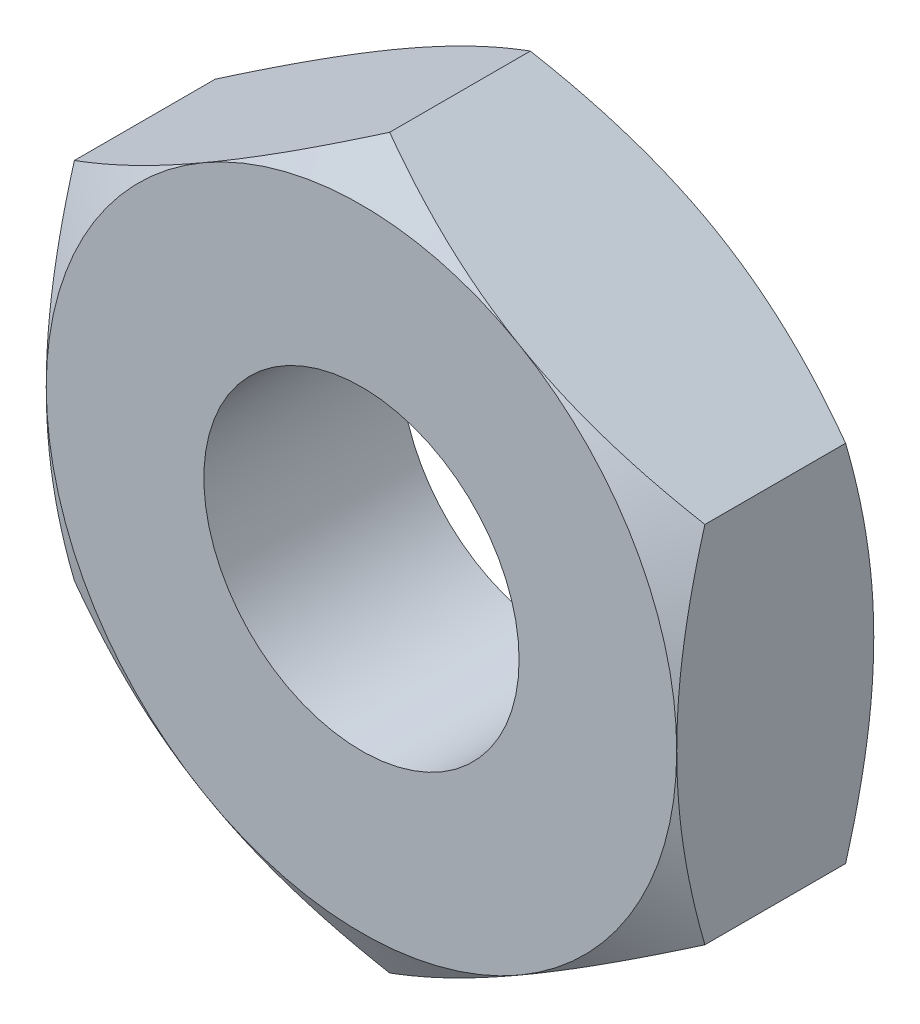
ISO-10303-21;
HEADER;
FILE_DESCRIPTION(('STEP AP214'),'2;1');
FILE_NAME('part.step','',(''),(''),'','','');
FILE_SCHEMA(('AUTOMOTIVE_DESIGN { 1 0 10303 214 1 1 1 1 }'));
ENDSEC;
DATA;
#1=APPLICATION_CONTEXT('core data for automotive mechanical design processes');
#2=APPLICATION_PROTOCOL_DEFINITION('international standard','automotive_design',2000,#1);
#3=PRODUCT_CONTEXT('',#1,'mechanical');
#4=PRODUCT('Part','Part','',(#3));
#5=PRODUCT_RELATED_PRODUCT_CATEGORY('part','',(#4));
#6=PRODUCT_DEFINITION_FORMATION('','',#4);
#7=PRODUCT_DEFINITION_CONTEXT('part definition',#1,'design');
#8=PRODUCT_DEFINITION('design','',#6,#7);
#9=PRODUCT_DEFINITION_SHAPE('','',#8);
#10=(LENGTH_UNIT() NAMED_UNIT(*) SI_UNIT(.MILLI.,.METRE.));
#11=(NAMED_UNIT(*) PLANE_ANGLE_UNIT() SI_UNIT($,.RADIAN.));
#12=(NAMED_UNIT(*) SI_UNIT($,.STERADIAN.) SOLID_ANGLE_UNIT());
#13=UNCERTAINTY_MEASURE_WITH_UNIT(LENGTH_MEASURE(1.E-05),#10,'distance_accuracy_value','');
#14=(GEOMETRIC_REPRESENTATION_CONTEXT(3) GLOBAL_UNCERTAINTY_ASSIGNED_CONTEXT((#13)) GLOBAL_UNIT_ASSIGNED_CONTEXT((#10,
#11,#12)) REPRESENTATION_CONTEXT('',''));
#15=CARTESIAN_POINT('',(0.,0.,0.));
#16=DIRECTION('',(0.,0.,1.));
#17=DIRECTION('',(1.,0.,0.));
#18=AXIS2_PLACEMENT_3D('',#15,#16,#17);
#19=CARTESIAN_POINT('',(-8.,13.856406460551,0.));
#20=DIRECTION('',(0.,0.,-1.));
#21=DIRECTION('',(-1.,0.,0.));
#22=AXIS2_PLACEMENT_3D('',#19,#20,#21);
#23=PLANE('',#22);
#24=CARTESIAN_POINT('',(0.,0.,0.));
#25=DIRECTION('',(0.,0.,-1.));
#26=DIRECTION('',(-1.,0.,0.));
#27=AXIS2_PLACEMENT_3D('',#24,#25,#26);
#28=CIRCLE('',#27,8.);
#29=CARTESIAN_POINT('',(-8.,0.,0.));
#30=VERTEX_POINT('',#29);
#31=CARTESIAN_POINT('',(-4.,6.92820323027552,0.));
#32=VERTEX_POINT('',#31);
#33=EDGE_CURVE('E474',#30,#32,#28,.T.);
#34=ORIENTED_EDGE('',*,*,#33,.F.);
#35=CARTESIAN_POINT('',(0.,0.,0.));
#36=DIRECTION('',(0.,0.,-1.));
#37=DIRECTION('',(-1.,0.,0.));
#38=AXIS2_PLACEMENT_3D('',#35,#36,#37);
#39=CIRCLE('',#38,8.);
#40=CARTESIAN_POINT('',(-4.,-6.92820323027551,0.));
#41=VERTEX_POINT('',#40);
#42=EDGE_CURVE('E151',#30,#41,#39,.F.);
#43=ORIENTED_EDGE('',*,*,#42,.T.);
#44=CARTESIAN_POINT('',(4.,-6.92820323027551,0.));
#45=VERTEX_POINT('',#44);
#46=EDGE_CURVE('E253',#41,#45,#39,.F.);
#47=ORIENTED_EDGE('',*,*,#46,.T.);
#48=CARTESIAN_POINT('',(8.,0.,0.));
#49=VERTEX_POINT('',#48);
#50=EDGE_CURVE('E155',#45,#49,#39,.F.);
#51=ORIENTED_EDGE('',*,*,#50,.T.);
#52=CARTESIAN_POINT('',(4.,6.92820323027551,0.));
#53=VERTEX_POINT('',#52);
#54=EDGE_CURVE('E129',#49,#53,#39,.F.);
#55=ORIENTED_EDGE('',*,*,#54,.T.);
#56=EDGE_CURVE('E142',#53,#32,#39,.F.);
#57=ORIENTED_EDGE('',*,*,#56,.T.);
#58=EDGE_LOOP('',(#34,#43,#47,#51,#55,#57));
#59=FACE_BOUND('',#58,.T.);
#60=CARTESIAN_POINT('',(0.,0.,0.));
#61=DIRECTION('',(0.,0.,1.));
#62=DIRECTION('',(1.,0.,0.));
#63=AXIS2_PLACEMENT_3D('',#60,#61,#62);
#64=CIRCLE('',#63,4.);
#65=CARTESIAN_POINT('',(4.,0.,0.));
#66=VERTEX_POINT('',#65);
#67=EDGE_CURVE('E467',#66,#66,#64,.T.);
#68=ORIENTED_EDGE('',*,*,#67,.F.);
#69=EDGE_LOOP('',(#68));
#70=FACE_BOUND('',#69,.T.);
#71=ADVANCED_FACE('F34',(#59,#70),#23,.F.);
#72=CARTESIAN_POINT('',(0.,0.,0.));
#73=DIRECTION('',(0.,0.,-1.));
#74=DIRECTION('',(-1.,0.,0.));
#75=AXIS2_PLACEMENT_3D('',#72,#73,#74);
#76=CONICAL_SURFACE('',#75,8.,1.0471975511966);
#77=CARTESIAN_POINT('',(-8.,-12.4991295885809,-3.94912720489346));
#78=CARTESIAN_POINT('',(-8.,-12.1489394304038,-3.77888389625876));
#79=CARTESIAN_POINT('',(-8.,-11.7979552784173,-3.61024636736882));
#80=CARTESIAN_POINT('',(-8.,-11.0939770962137,-3.27708413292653));
#81=CARTESIAN_POINT('',(-8.,-10.740982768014,-3.11256005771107));
#82=CARTESIAN_POINT('',(-8.,-10.030787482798,-2.78771791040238));
#83=CARTESIAN_POINT('',(-8.,-9.67357414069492,-2.6274268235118));
#84=CARTESIAN_POINT('',(-8.,-8.9563386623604,-2.31328154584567));
#85=CARTESIAN_POINT('',(-8.,-8.59631665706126,-2.15942705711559));
#86=CARTESIAN_POINT('',(-8.,-7.86090115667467,-1.85488605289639));
#87=CARTESIAN_POINT('',(-8.,-7.48539361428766,-1.70447344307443));
#88=CARTESIAN_POINT('',(-8.,-6.73002047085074,-1.41480963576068));
#89=CARTESIAN_POINT('',(-8.,-6.35015439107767,-1.27555967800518));
#90=CARTESIAN_POINT('',(-8.,-5.58613691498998,-1.01180961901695));
#91=CARTESIAN_POINT('',(-8.,-5.20199566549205,-0.887280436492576));
#92=CARTESIAN_POINT('',(-8.,-4.42821677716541,-0.656905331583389));
#93=CARTESIAN_POINT('',(-8.,-4.0385808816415,-0.551053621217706));
#94=CARTESIAN_POINT('',(-8.,-3.25571853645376,-0.363629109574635));
#95=CARTESIAN_POINT('',(-8.,-2.86252545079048,-0.281920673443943));
#96=CARTESIAN_POINT('',(-8.,-2.26908224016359,-0.180952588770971));
#97=CARTESIAN_POINT('',(-8.,-2.07064497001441,-0.150894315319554));
#98=CARTESIAN_POINT('',(-8.,-1.67275295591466,-0.0985632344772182));
#99=CARTESIAN_POINT('',(-8.,-1.47329831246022,-0.076289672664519));
#100=CARTESIAN_POINT('',(-8.,-1.07628454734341,-0.0402560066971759));
#101=CARTESIAN_POINT('',(-8.,-0.878735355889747,-0.0263869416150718));
#102=CARTESIAN_POINT('',(-8.,-0.483227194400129,-0.00701987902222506));
#103=CARTESIAN_POINT('',(-8.,-0.285268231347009,-0.00152174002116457));
#104=CARTESIAN_POINT('',(-8.,0.11070467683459,0.000971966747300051));
#105=CARTESIAN_POINT('',(-8.,0.308718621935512,-0.00203246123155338));
#106=CARTESIAN_POINT('',(-8.,0.704441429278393,-0.016469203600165));
#107=CARTESIAN_POINT('',(-8.,0.902150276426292,-0.0279019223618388));
#108=CARTESIAN_POINT('',(-8.,1.37453758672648,-0.0650429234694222));
#109=CARTESIAN_POINT('',(-8.,1.64892037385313,-0.0945963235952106));
#110=CARTESIAN_POINT('',(-8.,2.1956968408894,-0.168344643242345));
#111=CARTESIAN_POINT('',(-8.,2.46809025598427,-0.212541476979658));
#112=CARTESIAN_POINT('',(-8.,3.28194942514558,-0.364757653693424));
#113=CARTESIAN_POINT('',(-8.,3.81980065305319,-0.492376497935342));
#114=CARTESIAN_POINT('',(-8.,4.62413397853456,-0.71428340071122));
#115=CARTESIAN_POINT('',(-8.,4.8947723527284,-0.794378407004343));
#116=CARTESIAN_POINT('',(-8.,5.43342212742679,-0.963040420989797));
#117=CARTESIAN_POINT('',(-8.,5.70143351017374,-1.05160748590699));
#118=CARTESIAN_POINT('',(-8.,6.23491036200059,-1.23577996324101));
#119=CARTESIAN_POINT('',(-8.,6.50037660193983,-1.33138316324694));
#120=CARTESIAN_POINT('',(-8.,7.02909965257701,-1.52848785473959));
#121=CARTESIAN_POINT('',(-8.,7.29235649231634,-1.62998926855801));
#122=CARTESIAN_POINT('',(-8.,7.92547387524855,-1.88094962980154));
#123=CARTESIAN_POINT('',(-8.,8.29435733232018,-2.03286934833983));
#124=CARTESIAN_POINT('',(-8.,9.02887267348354,-2.34439931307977));
#125=CARTESIAN_POINT('',(-8.,9.39450433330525,-2.50401008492));
#126=CARTESIAN_POINT('',(-8.,10.1231400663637,-2.82934351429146));
#127=CARTESIAN_POINT('',(-8.,10.4861434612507,-2.99506768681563));
#128=CARTESIAN_POINT('',(-8.,11.2098817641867,-3.33136251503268));
#129=CARTESIAN_POINT('',(-8.,11.5706167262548,-3.50193305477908));
#130=CARTESIAN_POINT('',(-8.,12.2906311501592,-3.84719579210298));
#131=CARTESIAN_POINT('',(-8.,12.6499083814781,-4.0218926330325));
#132=CARTESIAN_POINT('',(-8.,13.3668824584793,-4.37449868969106));
#133=CARTESIAN_POINT('',(-8.,13.7245792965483,-4.55240792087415));
#134=CARTESIAN_POINT('',(-8.,14.7955835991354,-5.09002985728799));
#135=CARTESIAN_POINT('',(-8.,15.5069102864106,-5.45368780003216));
#136=CARTESIAN_POINT('',(-8.,16.8639258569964,-6.15633107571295));
#137=CARTESIAN_POINT('',(-8.,17.5099328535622,-6.4947048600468));
#138=CARTESIAN_POINT('',(-8.,18.7995495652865,-7.17604821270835));
#139=CARTESIAN_POINT('',(-8.,19.4431591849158,-7.51901796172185));
#140=CARTESIAN_POINT('',(-8.,20.7267951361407,-8.20752021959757));
#141=CARTESIAN_POINT('',(-8.,21.3668264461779,-8.55304346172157));
#142=CARTESIAN_POINT('',(-8.,22.6453631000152,-9.24681283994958));
#143=CARTESIAN_POINT('',(-8.,23.2838685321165,-9.59505881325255));
#144=CARTESIAN_POINT('',(-8.,23.9218162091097,-9.94431668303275));
#145=B_SPLINE_CURVE_WITH_KNOTS('',3,(#77,#78,#79,#80,#81,#82,#83,#84,#85,#86,#87,#88,#89,#90,
#91,#92,#93,#94,#95,#96,#97,#98,#99,#100,#101,#102,#103,#104,#105,#106,#107,#108,#109,#110,#111,
#112,#113,#114,#115,#116,#117,#118,#119,#120,#121,#122,#123,#124,#125,#126,#127,#128,#129,#130,
#131,#132,#133,#134,#135,#136,#137,#138,#139,#140,#141,#142,#143,#144),.UNSPECIFIED.,.F.,.F.,(4,
2,2,2,2,2,2,2,2,2,2,2,2,2,2,2,2,2,2,2,2,2,2,2,2,2,2,2,2,2,2,2,2,4),(0.,1.16815052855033,
2.33647897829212,3.51101368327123,4.68549395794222,5.8988918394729,7.11242429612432,
8.32351783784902,9.53423541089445,10.7380159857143,11.3399900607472,11.9419057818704,
12.5358409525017,13.1297660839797,13.7236909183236,14.3176442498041,15.1450878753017,
15.9726397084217,17.6286232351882,18.4752751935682,19.3219328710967,20.1683254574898,
21.014706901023,22.2114131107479,23.4082012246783,24.6052879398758,25.8023460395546,
27.0008222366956,28.1993042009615,30.5959168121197,32.7836807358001,34.9715309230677,
37.1535499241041,39.3354394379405),.UNSPECIFIED.);
#146=CARTESIAN_POINT('',(-8.,4.61880215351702,-0.714531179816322));
#147=VERTEX_POINT('',#146);
#148=EDGE_CURVE('E160',#147,#30,#145,.F.);
#149=ORIENTED_EDGE('',*,*,#148,.T.);
#150=ORIENTED_EDGE('',*,*,#33,.T.);
#151=CARTESIAN_POINT('',(0.0002,9.23771977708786,-0.714597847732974));
#152=CARTESIAN_POINT('',(-0.175648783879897,9.13619343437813,-0.655990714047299));
#153=CARTESIAN_POINT('',(-0.352153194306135,9.03428856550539,-0.600043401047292));
#154=CARTESIAN_POINT('',(-0.70659546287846,8.82965122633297,-0.494201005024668));
#155=CARTESIAN_POINT('',(-0.884533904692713,8.72691841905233,-0.444308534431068));
#156=CARTESIAN_POINT('',(-1.42119823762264,8.41707512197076,-0.304692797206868));
#157=CARTESIAN_POINT('',(-1.78204258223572,8.20874154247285,-0.225281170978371));
#158=CARTESIAN_POINT('',(-2.32203917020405,7.89697436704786,-0.132161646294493));
#159=CARTESIAN_POINT('',(-2.49957818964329,7.79447216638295,-0.105634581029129));
#160=CARTESIAN_POINT('',(-2.8554591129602,7.58900421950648,-0.061153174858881));
#161=CARTESIAN_POINT('',(-3.03380094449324,7.48603851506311,-0.0431980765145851));
#162=CARTESIAN_POINT('',(-3.3907916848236,7.27992981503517,-0.0163156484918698));
#163=CARTESIAN_POINT('',(-3.5694400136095,7.17678715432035,-0.0073780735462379));
#164=CARTESIAN_POINT('',(-3.92690170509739,6.97040655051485,0.00127769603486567));
#165=CARTESIAN_POINT('',(-4.10571506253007,6.86716861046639,0.000996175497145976));
#166=CARTESIAN_POINT('',(-4.44001336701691,6.67416139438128,-0.00814502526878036));
#167=CARTESIAN_POINT('',(-4.59552190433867,6.58437849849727,-0.0158896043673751));
#168=CARTESIAN_POINT('',(-4.90617476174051,6.40502298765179,-0.0382011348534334));
#169=CARTESIAN_POINT('',(-5.06131905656,6.31545038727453,-0.0527685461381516));
#170=CARTESIAN_POINT('',(-5.52615131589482,6.04707935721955,-0.106360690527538));
#171=CARTESIAN_POINT('',(-5.83501648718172,5.86875596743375,-0.155268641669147));
#172=CARTESIAN_POINT('',(-6.4560232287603,5.51021755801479,-0.277539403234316));
#173=CARTESIAN_POINT('',(-6.76808554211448,5.33004829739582,-0.351420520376));
#174=CARTESIAN_POINT('',(-7.38755648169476,4.97239658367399,-0.51910014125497));
#175=CARTESIAN_POINT('',(-7.69497304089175,4.79490955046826,-0.612859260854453));
#176=CARTESIAN_POINT('',(-8.0002,4.61868668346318,-0.714597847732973));
#177=B_SPLINE_CURVE_WITH_KNOTS('',3,(#151,#152,#153,#154,#155,#156,#157,#158,#159,#160,#161,
#162,#163,#164,#165,#166,#167,#168,#169,#170,#171,#172,#173,#174,#175,#176),.UNSPECIFIED.,.F.,
.F.,(4,2,2,2,2,2,2,2,2,2,2,2,4),(0.,0.63397354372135,1.26821965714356,2.53934712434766,
3.15934343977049,3.77928496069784,4.39852133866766,5.01773858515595,5.55680239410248,
6.09590254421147,7.17487077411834,8.27776850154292,9.37850115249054),.UNSPECIFIED.);
#178=EDGE_CURVE('E192',#32,#147,#177,.T.);
#179=ORIENTED_EDGE('',*,*,#178,.T.);
#180=EDGE_LOOP('',(#149,#150,#179));
#181=FACE_BOUND('',#180,.T.);
#182=ADVANCED_FACE('F179',(#181),#76,.T.);
#183=CARTESIAN_POINT('',(8.0002,4.61868668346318,-0.714597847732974));
#184=CARTESIAN_POINT('',(7.8243512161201,4.72021302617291,-0.655990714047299));
#185=CARTESIAN_POINT('',(7.64784680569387,4.82211789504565,-0.600043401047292));
#186=CARTESIAN_POINT('',(7.29340453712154,5.02675523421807,-0.494201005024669));
#187=CARTESIAN_POINT('',(7.11546609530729,5.12948804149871,-0.444308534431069));
#188=CARTESIAN_POINT('',(6.57880176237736,5.43933133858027,-0.304692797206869));
#189=CARTESIAN_POINT('',(6.21795741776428,5.64766491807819,-0.225281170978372));
#190=CARTESIAN_POINT('',(5.67796082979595,5.95943209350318,-0.132161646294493));
#191=CARTESIAN_POINT('',(5.50042181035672,6.06193429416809,-0.105634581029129));
#192=CARTESIAN_POINT('',(5.1445408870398,6.26740224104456,-0.0611531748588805));
#193=CARTESIAN_POINT('',(4.96619905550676,6.37036794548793,-0.0431980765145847));
#194=CARTESIAN_POINT('',(4.6092083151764,6.57647664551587,-0.0163156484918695));
#195=CARTESIAN_POINT('',(4.4305599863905,6.67961930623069,-0.00737807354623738));
#196=CARTESIAN_POINT('',(4.07309829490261,6.88599991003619,0.00127769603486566));
#197=CARTESIAN_POINT('',(3.89428493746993,6.98923785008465,0.00099617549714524));
#198=CARTESIAN_POINT('',(3.55998663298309,7.18224506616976,-0.00814502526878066));
#199=CARTESIAN_POINT('',(3.40447809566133,7.27202796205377,-0.0158896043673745));
#200=CARTESIAN_POINT('',(3.09382523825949,7.45138347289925,-0.0382011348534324));
#201=CARTESIAN_POINT('',(2.93868094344,7.54095607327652,-0.0527685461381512));
#202=CARTESIAN_POINT('',(2.47384868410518,7.80932710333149,-0.106360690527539));
#203=CARTESIAN_POINT('',(2.16498351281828,7.98765049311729,-0.155268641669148));
#204=CARTESIAN_POINT('',(1.5439767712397,8.34618890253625,-0.277539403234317));
#205=CARTESIAN_POINT('',(1.23191445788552,8.52635816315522,-0.351420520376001));
#206=CARTESIAN_POINT('',(0.612443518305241,8.88400987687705,-0.51910014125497));
#207=CARTESIAN_POINT('',(0.305026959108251,9.06149691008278,-0.612859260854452));
#208=CARTESIAN_POINT('',(-0.000199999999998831,9.23771977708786,-0.714597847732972));
#209=B_SPLINE_CURVE_WITH_KNOTS('',3,(#183,#184,#185,#186,#187,#188,#189,#190,#191,#192,#193,
#194,#195,#196,#197,#198,#199,#200,#201,#202,#203,#204,#205,#206,#207,#208),.UNSPECIFIED.,.F.,
.F.,(4,2,2,2,2,2,2,2,2,2,2,2,4),(0.,0.633973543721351,1.26821965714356,2.53934712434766,
3.15934343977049,3.77928496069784,4.39852133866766,5.01773858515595,5.55680239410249,
6.09590254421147,7.17487077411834,8.27776850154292,9.37850115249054),.UNSPECIFIED.);
#210=CARTESIAN_POINT('',(0.,9.23760430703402,-0.714531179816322));
#211=VERTEX_POINT('',#210);
#212=EDGE_CURVE('E138',#53,#211,#209,.T.);
#213=ORIENTED_EDGE('',*,*,#212,.T.);
#214=EDGE_CURVE('E145',#211,#32,#177,.T.);
#215=ORIENTED_EDGE('',*,*,#214,.T.);
#216=ORIENTED_EDGE('',*,*,#56,.F.);
#217=EDGE_LOOP('',(#213,#215,#216));
#218=FACE_BOUND('',#217,.T.);
#219=ADVANCED_FACE('F143',(#218),#76,.T.);
#220=CARTESIAN_POINT('',(8.,-12.4991295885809,-3.94912720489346));
#221=CARTESIAN_POINT('',(8.,-12.1489394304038,-3.77888389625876));
#222=CARTESIAN_POINT('',(8.,-11.7979552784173,-3.61024636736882));
#223=CARTESIAN_POINT('',(8.,-11.0939770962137,-3.27708413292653));
#224=CARTESIAN_POINT('',(8.,-10.740982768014,-3.11256005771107));
#225=CARTESIAN_POINT('',(8.,-10.030787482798,-2.78771791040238));
#226=CARTESIAN_POINT('',(8.,-9.67357414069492,-2.6274268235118));
#227=CARTESIAN_POINT('',(8.,-8.9563386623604,-2.31328154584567));
#228=CARTESIAN_POINT('',(8.,-8.59631665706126,-2.15942705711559));
#229=CARTESIAN_POINT('',(8.,-7.86090115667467,-1.85488605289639));
#230=CARTESIAN_POINT('',(8.,-7.48539361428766,-1.70447344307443));
#231=CARTESIAN_POINT('',(8.,-6.73002047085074,-1.41480963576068));
#232=CARTESIAN_POINT('',(8.,-6.35015439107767,-1.27555967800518));
#233=CARTESIAN_POINT('',(8.,-5.58613691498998,-1.01180961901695));
#234=CARTESIAN_POINT('',(8.,-5.20199566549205,-0.887280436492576));
#235=CARTESIAN_POINT('',(8.,-4.42821677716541,-0.656905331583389));
#236=CARTESIAN_POINT('',(8.,-4.0385808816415,-0.551053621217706));
#237=CARTESIAN_POINT('',(8.,-3.25571853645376,-0.363629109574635));
#238=CARTESIAN_POINT('',(8.,-2.86252545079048,-0.281920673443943));
#239=CARTESIAN_POINT('',(8.,-2.26908224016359,-0.180952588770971));
#240=CARTESIAN_POINT('',(8.,-2.07064497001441,-0.150894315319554));
#241=CARTESIAN_POINT('',(8.,-1.67275295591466,-0.0985632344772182));
#242=CARTESIAN_POINT('',(8.,-1.47329831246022,-0.076289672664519));
#243=CARTESIAN_POINT('',(8.,-1.07628454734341,-0.0402560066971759));
#244=CARTESIAN_POINT('',(8.,-0.878735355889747,-0.0263869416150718));
#245=CARTESIAN_POINT('',(8.,-0.483227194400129,-0.00701987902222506));
#246=CARTESIAN_POINT('',(8.,-0.285268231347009,-0.00152174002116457));
#247=CARTESIAN_POINT('',(8.,0.11070467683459,0.000971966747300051));
#248=CARTESIAN_POINT('',(8.,0.308718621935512,-0.00203246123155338));
#249=CARTESIAN_POINT('',(8.,0.704441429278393,-0.016469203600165));
#250=CARTESIAN_POINT('',(8.,0.902150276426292,-0.0279019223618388));
#251=CARTESIAN_POINT('',(8.,1.37453758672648,-0.0650429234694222));
#252=CARTESIAN_POINT('',(8.,1.64892037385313,-0.0945963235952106));
#253=CARTESIAN_POINT('',(8.,2.1956968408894,-0.168344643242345));
#254=CARTESIAN_POINT('',(8.,2.46809025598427,-0.212541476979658));
#255=CARTESIAN_POINT('',(8.,3.28194942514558,-0.364757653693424));
#256=CARTESIAN_POINT('',(8.,3.81980065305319,-0.492376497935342));
#257=CARTESIAN_POINT('',(8.,4.62413397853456,-0.71428340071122));
#258=CARTESIAN_POINT('',(8.,4.8947723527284,-0.794378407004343));
#259=CARTESIAN_POINT('',(8.,5.43342212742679,-0.963040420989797));
#260=CARTESIAN_POINT('',(8.,5.70143351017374,-1.05160748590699));
#261=CARTESIAN_POINT('',(8.,6.23491036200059,-1.23577996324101));
#262=CARTESIAN_POINT('',(8.,6.50037660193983,-1.33138316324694));
#263=CARTESIAN_POINT('',(8.,7.02909965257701,-1.52848785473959));
#264=CARTESIAN_POINT('',(8.,7.29235649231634,-1.62998926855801));
#265=CARTESIAN_POINT('',(8.,7.92547387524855,-1.88094962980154));
#266=CARTESIAN_POINT('',(8.,8.29435733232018,-2.03286934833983));
#267=CARTESIAN_POINT('',(8.,9.02887267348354,-2.34439931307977));
#268=CARTESIAN_POINT('',(8.,9.39450433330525,-2.50401008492));
#269=CARTESIAN_POINT('',(8.,10.1231400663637,-2.82934351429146));
#270=CARTESIAN_POINT('',(8.,10.4861434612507,-2.99506768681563));
#271=CARTESIAN_POINT('',(8.,11.2098817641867,-3.33136251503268));
#272=CARTESIAN_POINT('',(8.,11.5706167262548,-3.50193305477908));
#273=CARTESIAN_POINT('',(8.,12.2906311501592,-3.84719579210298));
#274=CARTESIAN_POINT('',(8.,12.6499083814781,-4.0218926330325));
#275=CARTESIAN_POINT('',(8.,13.3668824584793,-4.37449868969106));
#276=CARTESIAN_POINT('',(8.,13.7245792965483,-4.55240792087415));
#277=CARTESIAN_POINT('',(8.,14.7955835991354,-5.09002985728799));
#278=CARTESIAN_POINT('',(8.,15.5069102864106,-5.45368780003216));
#279=CARTESIAN_POINT('',(8.,16.8639258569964,-6.15633107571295));
#280=CARTESIAN_POINT('',(8.,17.5099328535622,-6.4947048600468));
#281=CARTESIAN_POINT('',(8.,18.7995495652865,-7.17604821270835));
#282=CARTESIAN_POINT('',(8.,19.4431591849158,-7.51901796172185));
#283=CARTESIAN_POINT('',(8.,20.7267951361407,-8.20752021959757));
#284=CARTESIAN_POINT('',(8.,21.3668264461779,-8.55304346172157));
#285=CARTESIAN_POINT('',(8.,22.6453631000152,-9.24681283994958));
#286=CARTESIAN_POINT('',(8.,23.2838685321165,-9.59505881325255));
#287=CARTESIAN_POINT('',(8.,23.9218162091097,-9.94431668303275));
#288=B_SPLINE_CURVE_WITH_KNOTS('',3,(#220,#221,#222,#223,#224,#225,#226,#227,#228,#229,#230,
#231,#232,#233,#234,#235,#236,#237,#238,#239,#240,#241,#242,#243,#244,#245,#246,#247,#248,#249,
#250,#251,#252,#253,#254,#255,#256,#257,#258,#259,#260,#261,#262,#263,#264,#265,#266,#267,#268,
#269,#270,#271,#272,#273,#274,#275,#276,#277,#278,#279,#280,#281,#282,#283,#284,#285,#286,#287),
.UNSPECIFIED.,.F.,.F.,(4,2,2,2,2,2,2,2,2,2,2,2,2,2,2,2,2,2,2,2,2,2,2,2,2,2,2,2,2,2,2,2,2,4),(0.,
1.16815052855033,2.33647897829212,3.51101368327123,4.68549395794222,5.8988918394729,
7.11242429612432,8.32351783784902,9.53423541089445,10.7380159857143,11.3399900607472,
11.9419057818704,12.5358409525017,13.1297660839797,13.7236909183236,14.3176442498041,
15.1450878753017,15.9726397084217,17.6286232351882,18.4752751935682,19.3219328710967,
20.1683254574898,21.014706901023,22.2114131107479,23.4082012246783,24.6052879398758,
25.8023460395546,27.0008222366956,28.1993042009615,30.5959168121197,32.7836807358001,
34.9715309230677,37.1535499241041,39.3354394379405),.UNSPECIFIED.);
#289=CARTESIAN_POINT('',(8.,4.61880215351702,-0.714531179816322));
#290=VERTEX_POINT('',#289);
#291=EDGE_CURVE('E132',#49,#290,#288,.T.);
#292=ORIENTED_EDGE('',*,*,#291,.T.);
#293=EDGE_CURVE('E125',#290,#53,#209,.T.);
#294=ORIENTED_EDGE('',*,*,#293,.T.);
#295=ORIENTED_EDGE('',*,*,#54,.F.);
#296=EDGE_LOOP('',(#292,#294,#295));
#297=FACE_BOUND('',#296,.T.);
#298=ADVANCED_FACE('F127',(#297),#76,.T.);
#299=CARTESIAN_POINT('',(-0.0002,-9.23771977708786,-0.714597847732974));
#300=CARTESIAN_POINT('',(0.175648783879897,-9.13619343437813,-0.655990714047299));
#301=CARTESIAN_POINT('',(0.352153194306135,-9.03428856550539,-0.600043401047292));
#302=CARTESIAN_POINT('',(0.70659546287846,-8.82965122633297,-0.494201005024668));
#303=CARTESIAN_POINT('',(0.884533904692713,-8.72691841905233,-0.444308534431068));
#304=CARTESIAN_POINT('',(1.42119823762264,-8.41707512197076,-0.304692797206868));
#305=CARTESIAN_POINT('',(1.78204258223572,-8.20874154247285,-0.225281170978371));
#306=CARTESIAN_POINT('',(2.32203917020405,-7.89697436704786,-0.132161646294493));
#307=CARTESIAN_POINT('',(2.49957818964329,-7.79447216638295,-0.105634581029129));
#308=CARTESIAN_POINT('',(2.8554591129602,-7.58900421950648,-0.061153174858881));
#309=CARTESIAN_POINT('',(3.03380094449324,-7.48603851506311,-0.0431980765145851));
#310=CARTESIAN_POINT('',(3.3907916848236,-7.27992981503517,-0.0163156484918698));
#311=CARTESIAN_POINT('',(3.5694400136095,-7.17678715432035,-0.0073780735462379));
#312=CARTESIAN_POINT('',(3.92690170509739,-6.97040655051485,0.00127769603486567));
#313=CARTESIAN_POINT('',(4.10571506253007,-6.86716861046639,0.000996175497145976));
#314=CARTESIAN_POINT('',(4.44001336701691,-6.67416139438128,-0.00814502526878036));
#315=CARTESIAN_POINT('',(4.59552190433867,-6.58437849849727,-0.0158896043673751));
#316=CARTESIAN_POINT('',(4.90617476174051,-6.40502298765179,-0.0382011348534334));
#317=CARTESIAN_POINT('',(5.06131905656,-6.31545038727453,-0.0527685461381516));
#318=CARTESIAN_POINT('',(5.52615131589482,-6.04707935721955,-0.106360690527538));
#319=CARTESIAN_POINT('',(5.83501648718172,-5.86875596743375,-0.155268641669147));
#320=CARTESIAN_POINT('',(6.4560232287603,-5.51021755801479,-0.277539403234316));
#321=CARTESIAN_POINT('',(6.76808554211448,-5.33004829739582,-0.351420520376));
#322=CARTESIAN_POINT('',(7.38755648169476,-4.97239658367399,-0.51910014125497));
#323=CARTESIAN_POINT('',(7.69497304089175,-4.79490955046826,-0.612859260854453));
#324=CARTESIAN_POINT('',(8.0002,-4.61868668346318,-0.714597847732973));
#325=B_SPLINE_CURVE_WITH_KNOTS('',3,(#299,#300,#301,#302,#303,#304,#305,#306,#307,#308,#309,
#310,#311,#312,#313,#314,#315,#316,#317,#318,#319,#320,#321,#322,#323,#324),.UNSPECIFIED.,.F.,
.F.,(4,2,2,2,2,2,2,2,2,2,2,2,4),(0.,0.63397354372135,1.26821965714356,2.53934712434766,
3.15934343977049,3.77928496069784,4.39852133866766,5.01773858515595,5.55680239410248,
6.09590254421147,7.17487077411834,8.27776850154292,9.37850115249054),.UNSPECIFIED.);
#326=CARTESIAN_POINT('',(8.,-4.61880215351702,-0.714531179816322));
#327=VERTEX_POINT('',#326);
#328=EDGE_CURVE('E206',#45,#327,#325,.T.);
#329=ORIENTED_EDGE('',*,*,#328,.T.);
#330=EDGE_CURVE('E205',#327,#49,#288,.T.);
#331=ORIENTED_EDGE('',*,*,#330,.T.);
#332=ORIENTED_EDGE('',*,*,#50,.F.);
#333=EDGE_LOOP('',(#329,#331,#332));
#334=FACE_BOUND('',#333,.T.);
#335=ADVANCED_FACE('F335',(#334),#76,.T.);
#336=CARTESIAN_POINT('',(0.,-9.23760430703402,-0.714531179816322));
#337=VERTEX_POINT('',#336);
#338=EDGE_CURVE('E263',#337,#45,#325,.T.);
#339=ORIENTED_EDGE('',*,*,#338,.T.);
#340=ORIENTED_EDGE('',*,*,#46,.F.);
#341=CARTESIAN_POINT('',(-8.0002,-4.61868668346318,-0.714597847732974));
#342=CARTESIAN_POINT('',(-7.8243512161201,-4.72021302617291,-0.655990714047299));
#343=CARTESIAN_POINT('',(-7.64784680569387,-4.82211789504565,-0.600043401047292));
#344=CARTESIAN_POINT('',(-7.29340453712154,-5.02675523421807,-0.494201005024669));
#345=CARTESIAN_POINT('',(-7.11546609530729,-5.12948804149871,-0.444308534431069));
#346=CARTESIAN_POINT('',(-6.57880176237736,-5.43933133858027,-0.304692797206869));
#347=CARTESIAN_POINT('',(-6.21795741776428,-5.64766491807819,-0.225281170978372));
#348=CARTESIAN_POINT('',(-5.67796082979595,-5.95943209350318,-0.132161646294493));
#349=CARTESIAN_POINT('',(-5.50042181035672,-6.06193429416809,-0.105634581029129));
#350=CARTESIAN_POINT('',(-5.1445408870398,-6.26740224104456,-0.0611531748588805));
#351=CARTESIAN_POINT('',(-4.96619905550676,-6.37036794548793,-0.0431980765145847));
#352=CARTESIAN_POINT('',(-4.6092083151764,-6.57647664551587,-0.0163156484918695));
#353=CARTESIAN_POINT('',(-4.4305599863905,-6.67961930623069,-0.00737807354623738));
#354=CARTESIAN_POINT('',(-4.07309829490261,-6.88599991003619,0.00127769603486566));
#355=CARTESIAN_POINT('',(-3.89428493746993,-6.98923785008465,0.00099617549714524));
#356=CARTESIAN_POINT('',(-3.55998663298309,-7.18224506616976,-0.00814502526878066));
#357=CARTESIAN_POINT('',(-3.40447809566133,-7.27202796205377,-0.0158896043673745));
#358=CARTESIAN_POINT('',(-3.09382523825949,-7.45138347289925,-0.0382011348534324));
#359=CARTESIAN_POINT('',(-2.93868094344,-7.54095607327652,-0.0527685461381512));
#360=CARTESIAN_POINT('',(-2.47384868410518,-7.80932710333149,-0.106360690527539));
#361=CARTESIAN_POINT('',(-2.16498351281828,-7.98765049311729,-0.155268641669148));
#362=CARTESIAN_POINT('',(-1.5439767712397,-8.34618890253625,-0.277539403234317));
#363=CARTESIAN_POINT('',(-1.23191445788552,-8.52635816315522,-0.351420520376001));
#364=CARTESIAN_POINT('',(-0.612443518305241,-8.88400987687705,-0.51910014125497));
#365=CARTESIAN_POINT('',(-0.305026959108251,-9.06149691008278,-0.612859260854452));
#366=CARTESIAN_POINT('',(0.000199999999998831,-9.23771977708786,-0.714597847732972));
#367=B_SPLINE_CURVE_WITH_KNOTS('',3,(#341,#342,#343,#344,#345,#346,#347,#348,#349,#350,#351,
#352,#353,#354,#355,#356,#357,#358,#359,#360,#361,#362,#363,#364,#365,#366),.UNSPECIFIED.,.F.,
.F.,(4,2,2,2,2,2,2,2,2,2,2,2,4),(0.,0.633973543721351,1.26821965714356,2.53934712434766,
3.15934343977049,3.77928496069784,4.39852133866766,5.01773858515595,5.55680239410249,
6.09590254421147,7.17487077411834,8.27776850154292,9.37850115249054),.UNSPECIFIED.);
#368=EDGE_CURVE('E267',#41,#337,#367,.T.);
#369=ORIENTED_EDGE('',*,*,#368,.T.);
#370=EDGE_LOOP('',(#339,#340,#369));
#371=FACE_BOUND('',#370,.T.);
#372=ADVANCED_FACE('F185',(#371),#76,.T.);
#373=CARTESIAN_POINT('',(-8.,-4.61880215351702,-0.714531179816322));
#374=VERTEX_POINT('',#373);
#375=EDGE_CURVE('E173',#374,#41,#367,.T.);
#376=ORIENTED_EDGE('',*,*,#375,.T.);
#377=ORIENTED_EDGE('',*,*,#42,.F.);
#378=EDGE_CURVE('E137',#30,#374,#145,.F.);
#379=ORIENTED_EDGE('',*,*,#378,.T.);
#380=EDGE_LOOP('',(#376,#377,#379));
#381=FACE_BOUND('',#380,.T.);
#382=ADVANCED_FACE('F272',(#381),#76,.T.);
#383=CARTESIAN_POINT('',(8.,4.61880215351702,-5.));
#384=DIRECTION('',(0.5,0.866025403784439,0.));
#385=DIRECTION('',(-0.866025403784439,0.5,0.));
#386=AXIS2_PLACEMENT_3D('',#383,#384,#385);
#387=PLANE('',#386);
#388=CARTESIAN_POINT('',(-0.0002,9.23771977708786,-4.28540215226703));
#389=CARTESIAN_POINT('',(0.175648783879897,9.13619343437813,-4.3440092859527));
#390=CARTESIAN_POINT('',(0.352153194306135,9.03428856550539,-4.39995659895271));
#391=CARTESIAN_POINT('',(0.70659546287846,8.82965122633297,-4.50579899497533));
#392=CARTESIAN_POINT('',(0.884533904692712,8.72691841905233,-4.55569146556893));
#393=CARTESIAN_POINT('',(1.42119823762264,8.41707512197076,-4.69530720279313));
#394=CARTESIAN_POINT('',(1.78204258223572,8.20874154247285,-4.77471882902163));
#395=CARTESIAN_POINT('',(2.32203917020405,7.89697436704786,-4.86783835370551));
#396=CARTESIAN_POINT('',(2.49957818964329,7.79447216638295,-4.89436541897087));
#397=CARTESIAN_POINT('',(2.8554591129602,7.58900421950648,-4.93884682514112));
#398=CARTESIAN_POINT('',(3.03380094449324,7.48603851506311,-4.95680192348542));
#399=CARTESIAN_POINT('',(3.3907916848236,7.27992981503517,-4.98368435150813));
#400=CARTESIAN_POINT('',(3.5694400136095,7.17678715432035,-4.99262192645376));
#401=CARTESIAN_POINT('',(3.92690170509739,6.97040655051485,-5.00127769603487));
#402=CARTESIAN_POINT('',(4.10571506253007,6.86716861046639,-5.00099617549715));
#403=CARTESIAN_POINT('',(4.44001336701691,6.67416139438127,-4.99185497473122));
#404=CARTESIAN_POINT('',(4.59552190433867,6.58437849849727,-4.98411039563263));
#405=CARTESIAN_POINT('',(4.90617476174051,6.40502298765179,-4.96179886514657));
#406=CARTESIAN_POINT('',(5.06131905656,6.31545038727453,-4.94723145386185));
#407=CARTESIAN_POINT('',(5.52615131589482,6.04707935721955,-4.89363930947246));
#408=CARTESIAN_POINT('',(5.83501648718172,5.86875596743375,-4.84473135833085));
#409=CARTESIAN_POINT('',(6.4560232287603,5.51021755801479,-4.72246059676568));
#410=CARTESIAN_POINT('',(6.76808554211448,5.33004829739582,-4.648579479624));
#411=CARTESIAN_POINT('',(7.38755648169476,4.97239658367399,-4.48089985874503));
#412=CARTESIAN_POINT('',(7.69497304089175,4.79490955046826,-4.38714073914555));
#413=CARTESIAN_POINT('',(8.0002,4.61868668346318,-4.28540215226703));
#414=B_SPLINE_CURVE_WITH_KNOTS('',3,(#388,#389,#390,#391,#392,#393,#394,#395,#396,#397,#398,
#399,#400,#401,#402,#403,#404,#405,#406,#407,#408,#409,#410,#411,#412,#413),.UNSPECIFIED.,.F.,
.F.,(4,2,2,2,2,2,2,2,2,2,2,2,4),(0.,0.63397354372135,1.26821965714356,2.53934712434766,
3.15934343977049,3.77928496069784,4.39852133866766,5.01773858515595,5.55680239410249,
6.09590254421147,7.17487077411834,8.27776850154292,9.37850115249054),.UNSPECIFIED.);
#415=CARTESIAN_POINT('',(0.,9.23760430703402,-4.28546882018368));
#416=VERTEX_POINT('',#415);
#417=CARTESIAN_POINT('',(4.,6.92820323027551,-5.));
#418=VERTEX_POINT('',#417);
#419=EDGE_CURVE('E238',#416,#418,#414,.T.);
#420=ORIENTED_EDGE('',*,*,#419,.F.);
#421=DIRECTION('',(0.,0.,1.));
#422=VECTOR('',#421,1.);
#423=CARTESIAN_POINT('',(0.,9.23760430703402,-5.));
#424=LINE('',#423,#422);
#425=EDGE_CURVE('E159',#416,#211,#424,.T.);
#426=ORIENTED_EDGE('',*,*,#425,.T.);
#427=ORIENTED_EDGE('',*,*,#212,.F.);
#428=ORIENTED_EDGE('',*,*,#293,.F.);
#429=DIRECTION('',(0.,0.,1.));
#430=VECTOR('',#429,1.);
#431=CARTESIAN_POINT('',(8.,4.61880215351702,-5.));
#432=LINE('',#431,#430);
#433=CARTESIAN_POINT('',(8.,4.61880215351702,-4.28546882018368));
#434=VERTEX_POINT('',#433);
#435=EDGE_CURVE('E150',#434,#290,#432,.T.);
#436=ORIENTED_EDGE('',*,*,#435,.F.);
#437=EDGE_CURVE('E233',#418,#434,#414,.T.);
#438=ORIENTED_EDGE('',*,*,#437,.F.);
#439=EDGE_LOOP('',(#420,#426,#427,#428,#436,#438));
#440=FACE_BOUND('',#439,.T.);
#441=ADVANCED_FACE('F36',(#440),#387,.T.);
#442=CARTESIAN_POINT('',(8.,-4.61880215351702,-5.));
#443=DIRECTION('',(1.,0.,0.));
#444=DIRECTION('',(0.,0.,-1.));
#445=AXIS2_PLACEMENT_3D('',#442,#443,#444);
#446=PLANE('',#445);
#447=CARTESIAN_POINT('',(8.,-12.4991295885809,-1.05087279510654));
#448=CARTESIAN_POINT('',(8.,-12.1489394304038,-1.22111610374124));
#449=CARTESIAN_POINT('',(8.,-11.7979552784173,-1.38975363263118));
#450=CARTESIAN_POINT('',(8.,-11.0939770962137,-1.72291586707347));
#451=CARTESIAN_POINT('',(8.,-10.740982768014,-1.88743994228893));
#452=CARTESIAN_POINT('',(8.,-10.030787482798,-2.21228208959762));
#453=CARTESIAN_POINT('',(8.,-9.67357414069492,-2.3725731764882));
#454=CARTESIAN_POINT('',(8.,-8.9563386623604,-2.68671845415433));
#455=CARTESIAN_POINT('',(8.,-8.59631665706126,-2.84057294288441));
#456=CARTESIAN_POINT('',(8.,-7.86090115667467,-3.14511394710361));
#457=CARTESIAN_POINT('',(8.,-7.48539361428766,-3.29552655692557));
#458=CARTESIAN_POINT('',(8.,-6.73002047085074,-3.58519036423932));
#459=CARTESIAN_POINT('',(8.,-6.35015439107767,-3.72444032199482));
#460=CARTESIAN_POINT('',(8.,-5.58613691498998,-3.98819038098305));
#461=CARTESIAN_POINT('',(8.,-5.20199566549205,-4.11271956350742));
#462=CARTESIAN_POINT('',(8.,-4.42821677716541,-4.34309466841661));
#463=CARTESIAN_POINT('',(8.,-4.0385808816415,-4.4489463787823));
#464=CARTESIAN_POINT('',(8.,-3.25571853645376,-4.63637089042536));
#465=CARTESIAN_POINT('',(8.,-2.86252545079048,-4.71807932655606));
#466=CARTESIAN_POINT('',(8.,-2.26908224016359,-4.81904741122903));
#467=CARTESIAN_POINT('',(8.,-2.07064497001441,-4.84910568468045));
#468=CARTESIAN_POINT('',(8.,-1.67275295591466,-4.90143676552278));
#469=CARTESIAN_POINT('',(8.,-1.47329831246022,-4.92371032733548));
#470=CARTESIAN_POINT('',(8.,-1.07628454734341,-4.95974399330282));
#471=CARTESIAN_POINT('',(8.,-0.878735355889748,-4.97361305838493));
#472=CARTESIAN_POINT('',(8.,-0.48322719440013,-4.99298012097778));
#473=CARTESIAN_POINT('',(8.,-0.285268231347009,-4.99847825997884));
#474=CARTESIAN_POINT('',(8.,0.11070467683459,-5.0009719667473));
#475=CARTESIAN_POINT('',(8.,0.308718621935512,-4.99796753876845));
#476=CARTESIAN_POINT('',(8.,0.704441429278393,-4.98353079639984));
#477=CARTESIAN_POINT('',(8.,0.902150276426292,-4.97209807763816));
#478=CARTESIAN_POINT('',(8.,1.37453758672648,-4.93495707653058));
#479=CARTESIAN_POINT('',(8.,1.64892037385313,-4.90540367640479));
#480=CARTESIAN_POINT('',(8.,2.1956968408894,-4.83165535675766));
#481=CARTESIAN_POINT('',(8.,2.46809025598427,-4.78745852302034));
#482=CARTESIAN_POINT('',(8.,3.28194942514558,-4.63524234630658));
#483=CARTESIAN_POINT('',(8.,3.81980065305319,-4.50762350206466));
#484=CARTESIAN_POINT('',(8.,4.62413397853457,-4.28571659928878));
#485=CARTESIAN_POINT('',(8.,4.8947723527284,-4.20562159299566));
#486=CARTESIAN_POINT('',(8.,5.43342212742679,-4.0369595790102));
#487=CARTESIAN_POINT('',(8.,5.70143351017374,-3.94839251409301));
#488=CARTESIAN_POINT('',(8.,6.23491036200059,-3.76422003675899));
#489=CARTESIAN_POINT('',(8.,6.50037660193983,-3.66861683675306));
#490=CARTESIAN_POINT('',(8.,7.02909965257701,-3.47151214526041));
#491=CARTESIAN_POINT('',(8.,7.29235649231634,-3.37001073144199));
#492=CARTESIAN_POINT('',(8.,7.92547387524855,-3.11905037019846));
#493=CARTESIAN_POINT('',(8.,8.29435733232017,-2.96713065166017));
#494=CARTESIAN_POINT('',(8.,9.02887267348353,-2.65560068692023));
#495=CARTESIAN_POINT('',(8.,9.39450433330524,-2.49598991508));
#496=CARTESIAN_POINT('',(8.,10.1231400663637,-2.17065648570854));
#497=CARTESIAN_POINT('',(8.,10.4861434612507,-2.00493231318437));
#498=CARTESIAN_POINT('',(8.,11.2098817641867,-1.66863748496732));
#499=CARTESIAN_POINT('',(8.,11.5706167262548,-1.49806694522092));
#500=CARTESIAN_POINT('',(8.,12.2906311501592,-1.15280420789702));
#501=CARTESIAN_POINT('',(8.,12.6499083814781,-0.978107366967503));
#502=CARTESIAN_POINT('',(8.,13.3668824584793,-0.625501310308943));
#503=CARTESIAN_POINT('',(8.,13.7245792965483,-0.44759207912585));
#504=CARTESIAN_POINT('',(8.,14.7955835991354,0.0900298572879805));
#505=CARTESIAN_POINT('',(8.,15.5069102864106,0.453687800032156));
#506=CARTESIAN_POINT('',(8.,16.8639258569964,1.15633107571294));
#507=CARTESIAN_POINT('',(8.,17.5099328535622,1.49470486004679));
#508=CARTESIAN_POINT('',(8.,18.7995495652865,2.17604821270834));
#509=CARTESIAN_POINT('',(8.,19.4431591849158,2.51901796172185));
#510=CARTESIAN_POINT('',(8.,20.7267951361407,3.20752021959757));
#511=CARTESIAN_POINT('',(8.,21.3668264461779,3.55304346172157));
#512=CARTESIAN_POINT('',(8.,22.6453631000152,4.24681283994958));
#513=CARTESIAN_POINT('',(8.,23.2838685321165,4.59505881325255));
#514=CARTESIAN_POINT('',(8.,23.9218162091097,4.94431668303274));
#515=B_SPLINE_CURVE_WITH_KNOTS('',3,(#447,#448,#449,#450,#451,#452,#453,#454,#455,#456,#457,
#458,#459,#460,#461,#462,#463,#464,#465,#466,#467,#468,#469,#470,#471,#472,#473,#474,#475,#476,
#477,#478,#479,#480,#481,#482,#483,#484,#485,#486,#487,#488,#489,#490,#491,#492,#493,#494,#495,
#496,#497,#498,#499,#500,#501,#502,#503,#504,#505,#506,#507,#508,#509,#510,#511,#512,#513,#514),
.UNSPECIFIED.,.F.,.F.,(4,2,2,2,2,2,2,2,2,2,2,2,2,2,2,2,2,2,2,2,2,2,2,2,2,2,2,2,2,2,2,2,2,4),(0.,
1.16815052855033,2.33647897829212,3.51101368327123,4.68549395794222,5.8988918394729,
7.11242429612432,8.32351783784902,9.53423541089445,10.7380159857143,11.3399900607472,
11.9419057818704,12.5358409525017,13.1297660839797,13.7236909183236,14.3176442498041,
15.1450878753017,15.9726397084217,17.6286232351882,18.4752751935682,19.3219328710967,
20.1683254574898,21.014706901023,22.2114131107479,23.4082012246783,24.6052879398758,
25.8023460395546,27.0008222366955,28.1993042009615,30.5959168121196,32.7836807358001,
34.9715309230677,37.1535499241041,39.3354394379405),.UNSPECIFIED.);
#516=CARTESIAN_POINT('',(8.,0.,-5.));
#517=VERTEX_POINT('',#516);
#518=EDGE_CURVE('E227',#434,#517,#515,.F.);
#519=ORIENTED_EDGE('',*,*,#518,.F.);
#520=ORIENTED_EDGE('',*,*,#435,.T.);
#521=ORIENTED_EDGE('',*,*,#291,.F.);
#522=ORIENTED_EDGE('',*,*,#330,.F.);
#523=DIRECTION('',(0.,0.,1.));
#524=VECTOR('',#523,1.);
#525=CARTESIAN_POINT('',(8.,-4.61880215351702,-5.));
#526=LINE('',#525,#524);
#527=CARTESIAN_POINT('',(8.,-4.61880215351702,-4.28546882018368));
#528=VERTEX_POINT('',#527);
#529=EDGE_CURVE('E240',#528,#327,#526,.T.);
#530=ORIENTED_EDGE('',*,*,#529,.F.);
#531=EDGE_CURVE('E221',#517,#528,#515,.F.);
#532=ORIENTED_EDGE('',*,*,#531,.F.);
#533=EDGE_LOOP('',(#519,#520,#521,#522,#530,#532));
#534=FACE_BOUND('',#533,.T.);
#535=ADVANCED_FACE('F212',(#534),#446,.T.);
#536=CARTESIAN_POINT('',(8.,-4.61880215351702,-5.));
#537=DIRECTION('',(0.5,-0.866025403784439,0.));
#538=DIRECTION('',(0.866025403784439,0.5,0.));
#539=AXIS2_PLACEMENT_3D('',#536,#537,#538);
#540=PLANE('',#539);
#541=CARTESIAN_POINT('',(8.0002,-4.61868668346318,-4.28540215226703));
#542=CARTESIAN_POINT('',(7.8243512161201,-4.72021302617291,-4.3440092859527));
#543=CARTESIAN_POINT('',(7.64784680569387,-4.82211789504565,-4.39995659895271));
#544=CARTESIAN_POINT('',(7.29340453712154,-5.02675523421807,-4.50579899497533));
#545=CARTESIAN_POINT('',(7.11546609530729,-5.12948804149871,-4.55569146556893));
#546=CARTESIAN_POINT('',(6.57880176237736,-5.43933133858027,-4.69530720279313));
#547=CARTESIAN_POINT('',(6.21795741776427,-5.64766491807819,-4.77471882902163));
#548=CARTESIAN_POINT('',(5.67796082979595,-5.95943209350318,-4.86783835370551));
#549=CARTESIAN_POINT('',(5.50042181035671,-6.06193429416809,-4.89436541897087));
#550=CARTESIAN_POINT('',(5.1445408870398,-6.26740224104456,-4.93884682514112));
#551=CARTESIAN_POINT('',(4.96619905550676,-6.37036794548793,-4.95680192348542));
#552=CARTESIAN_POINT('',(4.6092083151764,-6.57647664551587,-4.98368435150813));
#553=CARTESIAN_POINT('',(4.4305599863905,-6.67961930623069,-4.99262192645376));
#554=CARTESIAN_POINT('',(4.07309829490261,-6.88599991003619,-5.00127769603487));
#555=CARTESIAN_POINT('',(3.89428493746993,-6.98923785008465,-5.00099617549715));
#556=CARTESIAN_POINT('',(3.55998663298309,-7.18224506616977,-4.99185497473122));
#557=CARTESIAN_POINT('',(3.40447809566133,-7.27202796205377,-4.98411039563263));
#558=CARTESIAN_POINT('',(3.09382523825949,-7.45138347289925,-4.96179886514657));
#559=CARTESIAN_POINT('',(2.93868094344,-7.54095607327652,-4.94723145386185));
#560=CARTESIAN_POINT('',(2.47384868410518,-7.80932710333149,-4.89363930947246));
#561=CARTESIAN_POINT('',(2.16498351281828,-7.98765049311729,-4.84473135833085));
#562=CARTESIAN_POINT('',(1.5439767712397,-8.34618890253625,-4.72246059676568));
#563=CARTESIAN_POINT('',(1.23191445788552,-8.52635816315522,-4.648579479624));
#564=CARTESIAN_POINT('',(0.61244351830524,-8.88400987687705,-4.48089985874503));
#565=CARTESIAN_POINT('',(0.305026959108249,-9.06149691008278,-4.38714073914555));
#566=CARTESIAN_POINT('',(-0.000199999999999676,-9.23771977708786,-4.28540215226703));
#567=B_SPLINE_CURVE_WITH_KNOTS('',3,(#541,#542,#543,#544,#545,#546,#547,#548,#549,#550,#551,
#552,#553,#554,#555,#556,#557,#558,#559,#560,#561,#562,#563,#564,#565,#566),.UNSPECIFIED.,.F.,
.F.,(4,2,2,2,2,2,2,2,2,2,2,2,4),(0.,0.633973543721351,1.26821965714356,2.53934712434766,
3.15934343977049,3.77928496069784,4.39852133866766,5.01773858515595,5.55680239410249,
6.09590254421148,7.17487077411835,8.27776850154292,9.37850115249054),.UNSPECIFIED.);
#568=CARTESIAN_POINT('',(4.,-6.92820323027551,-5.));
#569=VERTEX_POINT('',#568);
#570=EDGE_CURVE('E58',#528,#569,#567,.T.);
#571=ORIENTED_EDGE('',*,*,#570,.F.);
#572=ORIENTED_EDGE('',*,*,#529,.T.);
#573=ORIENTED_EDGE('',*,*,#328,.F.);
#574=ORIENTED_EDGE('',*,*,#338,.F.);
#575=DIRECTION('',(0.,0.,1.));
#576=VECTOR('',#575,1.);
#577=CARTESIAN_POINT('',(0.,-9.23760430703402,-5.));
#578=LINE('',#577,#576);
#579=CARTESIAN_POINT('',(0.,-9.23760430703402,-4.28546882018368));
#580=VERTEX_POINT('',#579);
#581=EDGE_CURVE('E243',#580,#337,#578,.T.);
#582=ORIENTED_EDGE('',*,*,#581,.F.);
#583=EDGE_CURVE('E228',#569,#580,#567,.T.);
#584=ORIENTED_EDGE('',*,*,#583,.F.);
#585=EDGE_LOOP('',(#571,#572,#573,#574,#582,#584));
#586=FACE_BOUND('',#585,.T.);
#587=ADVANCED_FACE('F216',(#586),#540,.T.);
#588=CARTESIAN_POINT('',(-8.,-4.61880215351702,-5.));
#589=DIRECTION('',(-0.5,-0.866025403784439,0.));
#590=DIRECTION('',(0.866025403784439,-0.5,0.));
#591=AXIS2_PLACEMENT_3D('',#588,#589,#590);
#592=PLANE('',#591);
#593=CARTESIAN_POINT('',(0.0002,-9.23771977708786,-4.28540215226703));
#594=CARTESIAN_POINT('',(-0.175648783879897,-9.13619343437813,-4.3440092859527));
#595=CARTESIAN_POINT('',(-0.352153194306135,-9.03428856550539,-4.39995659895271));
#596=CARTESIAN_POINT('',(-0.70659546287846,-8.82965122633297,-4.50579899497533));
#597=CARTESIAN_POINT('',(-0.884533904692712,-8.72691841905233,-4.55569146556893));
#598=CARTESIAN_POINT('',(-1.42119823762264,-8.41707512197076,-4.69530720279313));
#599=CARTESIAN_POINT('',(-1.78204258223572,-8.20874154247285,-4.77471882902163));
#600=CARTESIAN_POINT('',(-2.32203917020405,-7.89697436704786,-4.86783835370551));
#601=CARTESIAN_POINT('',(-2.49957818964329,-7.79447216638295,-4.89436541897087));
#602=CARTESIAN_POINT('',(-2.8554591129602,-7.58900421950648,-4.93884682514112));
#603=CARTESIAN_POINT('',(-3.03380094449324,-7.48603851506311,-4.95680192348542));
#604=CARTESIAN_POINT('',(-3.3907916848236,-7.27992981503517,-4.98368435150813));
#605=CARTESIAN_POINT('',(-3.5694400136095,-7.17678715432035,-4.99262192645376));
#606=CARTESIAN_POINT('',(-3.92690170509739,-6.97040655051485,-5.00127769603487));
#607=CARTESIAN_POINT('',(-4.10571506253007,-6.86716861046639,-5.00099617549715));
#608=CARTESIAN_POINT('',(-4.44001336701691,-6.67416139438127,-4.99185497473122));
#609=CARTESIAN_POINT('',(-4.59552190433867,-6.58437849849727,-4.98411039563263));
#610=CARTESIAN_POINT('',(-4.90617476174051,-6.40502298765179,-4.96179886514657));
#611=CARTESIAN_POINT('',(-5.06131905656,-6.31545038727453,-4.94723145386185));
#612=CARTESIAN_POINT('',(-5.52615131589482,-6.04707935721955,-4.89363930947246));
#613=CARTESIAN_POINT('',(-5.83501648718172,-5.86875596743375,-4.84473135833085));
#614=CARTESIAN_POINT('',(-6.4560232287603,-5.51021755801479,-4.72246059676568));
#615=CARTESIAN_POINT('',(-6.76808554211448,-5.33004829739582,-4.648579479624));
#616=CARTESIAN_POINT('',(-7.38755648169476,-4.97239658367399,-4.48089985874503));
#617=CARTESIAN_POINT('',(-7.69497304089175,-4.79490955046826,-4.38714073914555));
#618=CARTESIAN_POINT('',(-8.0002,-4.61868668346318,-4.28540215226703));
#619=B_SPLINE_CURVE_WITH_KNOTS('',3,(#593,#594,#595,#596,#597,#598,#599,#600,#601,#602,#603,
#604,#605,#606,#607,#608,#609,#610,#611,#612,#613,#614,#615,#616,#617,#618),.UNSPECIFIED.,.F.,
.F.,(4,2,2,2,2,2,2,2,2,2,2,2,4),(0.,0.63397354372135,1.26821965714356,2.53934712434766,
3.15934343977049,3.77928496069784,4.39852133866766,5.01773858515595,5.55680239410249,
6.09590254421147,7.17487077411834,8.27776850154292,9.37850115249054),.UNSPECIFIED.);
#620=CARTESIAN_POINT('',(-4.,-6.92820323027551,-5.));
#621=VERTEX_POINT('',#620);
#622=EDGE_CURVE('E51',#580,#621,#619,.T.);
#623=ORIENTED_EDGE('',*,*,#622,.F.);
#624=ORIENTED_EDGE('',*,*,#581,.T.);
#625=ORIENTED_EDGE('',*,*,#368,.F.);
#626=ORIENTED_EDGE('',*,*,#375,.F.);
#627=DIRECTION('',(0.,0.,1.));
#628=VECTOR('',#627,1.);
#629=CARTESIAN_POINT('',(-8.,-4.61880215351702,-5.));
#630=LINE('',#629,#628);
#631=CARTESIAN_POINT('',(-8.,-4.61880215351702,-4.28546882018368));
#632=VERTEX_POINT('',#631);
#633=EDGE_CURVE('E246',#632,#374,#630,.T.);
#634=ORIENTED_EDGE('',*,*,#633,.F.);
#635=EDGE_CURVE('E287',#621,#632,#619,.T.);
#636=ORIENTED_EDGE('',*,*,#635,.F.);
#637=EDGE_LOOP('',(#623,#624,#625,#626,#634,#636));
#638=FACE_BOUND('',#637,.T.);
#639=ADVANCED_FACE('F277',(#638),#592,.T.);
#640=CARTESIAN_POINT('',(-8.,-4.61880215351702,-5.));
#641=DIRECTION('',(-1.,0.,0.));
#642=DIRECTION('',(0.,0.,1.));
#643=AXIS2_PLACEMENT_3D('',#640,#641,#642);
#644=PLANE('',#643);
#645=CARTESIAN_POINT('',(-8.,-12.4991295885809,-1.05087279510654));
#646=CARTESIAN_POINT('',(-8.,-12.1489394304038,-1.22111610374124));
#647=CARTESIAN_POINT('',(-8.,-11.7979552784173,-1.38975363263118));
#648=CARTESIAN_POINT('',(-8.,-11.0939770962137,-1.72291586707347));
#649=CARTESIAN_POINT('',(-8.,-10.740982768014,-1.88743994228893));
#650=CARTESIAN_POINT('',(-8.,-10.030787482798,-2.21228208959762));
#651=CARTESIAN_POINT('',(-8.,-9.67357414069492,-2.3725731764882));
#652=CARTESIAN_POINT('',(-8.,-8.9563386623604,-2.68671845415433));
#653=CARTESIAN_POINT('',(-8.,-8.59631665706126,-2.84057294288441));
#654=CARTESIAN_POINT('',(-8.,-7.86090115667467,-3.14511394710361));
#655=CARTESIAN_POINT('',(-8.,-7.48539361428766,-3.29552655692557));
#656=CARTESIAN_POINT('',(-8.,-6.73002047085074,-3.58519036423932));
#657=CARTESIAN_POINT('',(-8.,-6.35015439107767,-3.72444032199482));
#658=CARTESIAN_POINT('',(-8.,-5.58613691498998,-3.98819038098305));
#659=CARTESIAN_POINT('',(-8.,-5.20199566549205,-4.11271956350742));
#660=CARTESIAN_POINT('',(-8.,-4.42821677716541,-4.34309466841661));
#661=CARTESIAN_POINT('',(-8.,-4.0385808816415,-4.4489463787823));
#662=CARTESIAN_POINT('',(-8.,-3.25571853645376,-4.63637089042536));
#663=CARTESIAN_POINT('',(-8.,-2.86252545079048,-4.71807932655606));
#664=CARTESIAN_POINT('',(-8.,-2.26908224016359,-4.81904741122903));
#665=CARTESIAN_POINT('',(-8.,-2.07064497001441,-4.84910568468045));
#666=CARTESIAN_POINT('',(-8.,-1.67275295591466,-4.90143676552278));
#667=CARTESIAN_POINT('',(-8.,-1.47329831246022,-4.92371032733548));
#668=CARTESIAN_POINT('',(-8.,-1.07628454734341,-4.95974399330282));
#669=CARTESIAN_POINT('',(-8.,-0.878735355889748,-4.97361305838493));
#670=CARTESIAN_POINT('',(-8.,-0.48322719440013,-4.99298012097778));
#671=CARTESIAN_POINT('',(-8.,-0.285268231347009,-4.99847825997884));
#672=CARTESIAN_POINT('',(-8.,0.11070467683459,-5.0009719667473));
#673=CARTESIAN_POINT('',(-8.,0.308718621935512,-4.99796753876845));
#674=CARTESIAN_POINT('',(-8.,0.704441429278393,-4.98353079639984));
#675=CARTESIAN_POINT('',(-8.,0.902150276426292,-4.97209807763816));
#676=CARTESIAN_POINT('',(-8.,1.37453758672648,-4.93495707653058));
#677=CARTESIAN_POINT('',(-8.,1.64892037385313,-4.90540367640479));
#678=CARTESIAN_POINT('',(-8.,2.1956968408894,-4.83165535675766));
#679=CARTESIAN_POINT('',(-8.,2.46809025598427,-4.78745852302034));
#680=CARTESIAN_POINT('',(-8.,3.28194942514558,-4.63524234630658));
#681=CARTESIAN_POINT('',(-8.,3.81980065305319,-4.50762350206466));
#682=CARTESIAN_POINT('',(-8.,4.62413397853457,-4.28571659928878));
#683=CARTESIAN_POINT('',(-8.,4.8947723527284,-4.20562159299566));
#684=CARTESIAN_POINT('',(-8.,5.43342212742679,-4.0369595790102));
#685=CARTESIAN_POINT('',(-8.,5.70143351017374,-3.94839251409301));
#686=CARTESIAN_POINT('',(-8.,6.23491036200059,-3.76422003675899));
#687=CARTESIAN_POINT('',(-8.,6.50037660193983,-3.66861683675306));
#688=CARTESIAN_POINT('',(-8.,7.02909965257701,-3.47151214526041));
#689=CARTESIAN_POINT('',(-8.,7.29235649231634,-3.37001073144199));
#690=CARTESIAN_POINT('',(-8.,7.92547387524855,-3.11905037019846));
#691=CARTESIAN_POINT('',(-8.,8.29435733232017,-2.96713065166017));
#692=CARTESIAN_POINT('',(-8.,9.02887267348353,-2.65560068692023));
#693=CARTESIAN_POINT('',(-8.,9.39450433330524,-2.49598991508));
#694=CARTESIAN_POINT('',(-8.,10.1231400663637,-2.17065648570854));
#695=CARTESIAN_POINT('',(-8.,10.4861434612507,-2.00493231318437));
#696=CARTESIAN_POINT('',(-8.,11.2098817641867,-1.66863748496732));
#697=CARTESIAN_POINT('',(-8.,11.5706167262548,-1.49806694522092));
#698=CARTESIAN_POINT('',(-8.,12.2906311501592,-1.15280420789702));
#699=CARTESIAN_POINT('',(-8.,12.6499083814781,-0.978107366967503));
#700=CARTESIAN_POINT('',(-8.,13.3668824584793,-0.625501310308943));
#701=CARTESIAN_POINT('',(-8.,13.7245792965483,-0.44759207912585));
#702=CARTESIAN_POINT('',(-8.,14.7955835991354,0.0900298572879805));
#703=CARTESIAN_POINT('',(-8.,15.5069102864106,0.453687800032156));
#704=CARTESIAN_POINT('',(-8.,16.8639258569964,1.15633107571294));
#705=CARTESIAN_POINT('',(-8.,17.5099328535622,1.49470486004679));
#706=CARTESIAN_POINT('',(-8.,18.7995495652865,2.17604821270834));
#707=CARTESIAN_POINT('',(-8.,19.4431591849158,2.51901796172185));
#708=CARTESIAN_POINT('',(-8.,20.7267951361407,3.20752021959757));
#709=CARTESIAN_POINT('',(-8.,21.3668264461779,3.55304346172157));
#710=CARTESIAN_POINT('',(-8.,22.6453631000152,4.24681283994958));
#711=CARTESIAN_POINT('',(-8.,23.2838685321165,4.59505881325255));
#712=CARTESIAN_POINT('',(-8.,23.9218162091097,4.94431668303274));
#713=B_SPLINE_CURVE_WITH_KNOTS('',3,(#645,#646,#647,#648,#649,#650,#651,#652,#653,#654,#655,
#656,#657,#658,#659,#660,#661,#662,#663,#664,#665,#666,#667,#668,#669,#670,#671,#672,#673,#674,
#675,#676,#677,#678,#679,#680,#681,#682,#683,#684,#685,#686,#687,#688,#689,#690,#691,#692,#693,
#694,#695,#696,#697,#698,#699,#700,#701,#702,#703,#704,#705,#706,#707,#708,#709,#710,#711,#712),
.UNSPECIFIED.,.F.,.F.,(4,2,2,2,2,2,2,2,2,2,2,2,2,2,2,2,2,2,2,2,2,2,2,2,2,2,2,2,2,2,2,2,2,4),(0.,
1.16815052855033,2.33647897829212,3.51101368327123,4.68549395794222,5.8988918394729,
7.11242429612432,8.32351783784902,9.53423541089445,10.7380159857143,11.3399900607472,
11.9419057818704,12.5358409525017,13.1297660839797,13.7236909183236,14.3176442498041,
15.1450878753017,15.9726397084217,17.6286232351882,18.4752751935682,19.3219328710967,
20.1683254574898,21.014706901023,22.2114131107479,23.4082012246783,24.6052879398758,
25.8023460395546,27.0008222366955,28.1993042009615,30.5959168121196,32.7836807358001,
34.9715309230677,37.1535499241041,39.3354394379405),.UNSPECIFIED.);
#714=CARTESIAN_POINT('',(-8.,0.,-5.));
#715=VERTEX_POINT('',#714);
#716=EDGE_CURVE('E282',#632,#715,#713,.T.);
#717=ORIENTED_EDGE('',*,*,#716,.F.);
#718=ORIENTED_EDGE('',*,*,#633,.T.);
#719=ORIENTED_EDGE('',*,*,#378,.F.);
#720=ORIENTED_EDGE('',*,*,#148,.F.);
#721=DIRECTION('',(0.,0.,1.));
#722=VECTOR('',#721,1.);
#723=CARTESIAN_POINT('',(-8.,4.61880215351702,-5.));
#724=LINE('',#723,#722);
#725=CARTESIAN_POINT('',(-8.,4.61880215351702,-4.28546882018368));
#726=VERTEX_POINT('',#725);
#727=EDGE_CURVE('E249',#726,#147,#724,.T.);
#728=ORIENTED_EDGE('',*,*,#727,.F.);
#729=EDGE_CURVE('E284',#715,#726,#713,.T.);
#730=ORIENTED_EDGE('',*,*,#729,.F.);
#731=EDGE_LOOP('',(#717,#718,#719,#720,#728,#730));
#732=FACE_BOUND('',#731,.T.);
#733=ADVANCED_FACE('F280',(#732),#644,.T.);
#734=CARTESIAN_POINT('',(-8.,4.61880215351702,-5.));
#735=DIRECTION('',(-0.5,0.866025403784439,0.));
#736=DIRECTION('',(-0.866025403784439,-0.5,0.));
#737=AXIS2_PLACEMENT_3D('',#734,#735,#736);
#738=PLANE('',#737);
#739=CARTESIAN_POINT('',(-8.0002,4.61868668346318,-4.28540215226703));
#740=CARTESIAN_POINT('',(-7.8243512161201,4.72021302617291,-4.3440092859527));
#741=CARTESIAN_POINT('',(-7.64784680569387,4.82211789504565,-4.39995659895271));
#742=CARTESIAN_POINT('',(-7.29340453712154,5.02675523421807,-4.50579899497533));
#743=CARTESIAN_POINT('',(-7.11546609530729,5.12948804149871,-4.55569146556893));
#744=CARTESIAN_POINT('',(-6.57880176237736,5.43933133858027,-4.69530720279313));
#745=CARTESIAN_POINT('',(-6.21795741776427,5.64766491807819,-4.77471882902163));
#746=CARTESIAN_POINT('',(-5.67796082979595,5.95943209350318,-4.86783835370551));
#747=CARTESIAN_POINT('',(-5.50042181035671,6.06193429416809,-4.89436541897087));
#748=CARTESIAN_POINT('',(-5.1445408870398,6.26740224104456,-4.93884682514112));
#749=CARTESIAN_POINT('',(-4.96619905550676,6.37036794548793,-4.95680192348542));
#750=CARTESIAN_POINT('',(-4.6092083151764,6.57647664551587,-4.98368435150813));
#751=CARTESIAN_POINT('',(-4.4305599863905,6.67961930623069,-4.99262192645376));
#752=CARTESIAN_POINT('',(-4.07309829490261,6.88599991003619,-5.00127769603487));
#753=CARTESIAN_POINT('',(-3.89428493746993,6.98923785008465,-5.00099617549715));
#754=CARTESIAN_POINT('',(-3.55998663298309,7.18224506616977,-4.99185497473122));
#755=CARTESIAN_POINT('',(-3.40447809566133,7.27202796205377,-4.98411039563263));
#756=CARTESIAN_POINT('',(-3.09382523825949,7.45138347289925,-4.96179886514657));
#757=CARTESIAN_POINT('',(-2.93868094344,7.54095607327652,-4.94723145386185));
#758=CARTESIAN_POINT('',(-2.47384868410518,7.80932710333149,-4.89363930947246));
#759=CARTESIAN_POINT('',(-2.16498351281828,7.98765049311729,-4.84473135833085));
#760=CARTESIAN_POINT('',(-1.5439767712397,8.34618890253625,-4.72246059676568));
#761=CARTESIAN_POINT('',(-1.23191445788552,8.52635816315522,-4.648579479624));
#762=CARTESIAN_POINT('',(-0.61244351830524,8.88400987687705,-4.48089985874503));
#763=CARTESIAN_POINT('',(-0.305026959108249,9.06149691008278,-4.38714073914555));
#764=CARTESIAN_POINT('',(0.000199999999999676,9.23771977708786,-4.28540215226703));
#765=B_SPLINE_CURVE_WITH_KNOTS('',3,(#739,#740,#741,#742,#743,#744,#745,#746,#747,#748,#749,
#750,#751,#752,#753,#754,#755,#756,#757,#758,#759,#760,#761,#762,#763,#764),.UNSPECIFIED.,.F.,
.F.,(4,2,2,2,2,2,2,2,2,2,2,2,4),(0.,0.633973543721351,1.26821965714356,2.53934712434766,
3.15934343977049,3.77928496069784,4.39852133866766,5.01773858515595,5.55680239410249,
6.09590254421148,7.17487077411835,8.27776850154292,9.37850115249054),.UNSPECIFIED.);
#766=CARTESIAN_POINT('',(-4.,6.92820323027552,-5.));
#767=VERTEX_POINT('',#766);
#768=EDGE_CURVE('E289',#726,#767,#765,.T.);
#769=ORIENTED_EDGE('',*,*,#768,.F.);
#770=ORIENTED_EDGE('',*,*,#727,.T.);
#771=ORIENTED_EDGE('',*,*,#178,.F.);
#772=ORIENTED_EDGE('',*,*,#214,.F.);
#773=ORIENTED_EDGE('',*,*,#425,.F.);
#774=EDGE_CURVE('E268',#767,#416,#765,.T.);
#775=ORIENTED_EDGE('',*,*,#774,.F.);
#776=EDGE_LOOP('',(#769,#770,#771,#772,#773,#775));
#777=FACE_BOUND('',#776,.T.);
#778=ADVANCED_FACE('F301',(#777),#738,.T.);
#779=CARTESIAN_POINT('',(0.,0.,-2.5));
#780=DIRECTION('',(0.,0.,1.));
#781=DIRECTION('',(1.,0.,0.));
#782=AXIS2_PLACEMENT_3D('',#779,#780,#781);
#783=CONICAL_SURFACE('',#782,12.3301270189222,1.0471975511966);
#784=ORIENTED_EDGE('',*,*,#729,.T.);
#785=ORIENTED_EDGE('',*,*,#768,.T.);
#786=CARTESIAN_POINT('',(0.,0.,-5.));
#787=DIRECTION('',(0.,0.,-1.));
#788=DIRECTION('',(-1.,0.,0.));
#789=AXIS2_PLACEMENT_3D('',#786,#787,#788);
#790=CIRCLE('',#789,8.);
#791=EDGE_CURVE('E472',#715,#767,#790,.T.);
#792=ORIENTED_EDGE('',*,*,#791,.F.);
#793=EDGE_LOOP('',(#784,#785,#792));
#794=FACE_BOUND('',#793,.T.);
#795=ADVANCED_FACE('F187',(#794),#783,.T.);
#796=ORIENTED_EDGE('',*,*,#419,.T.);
#797=CARTESIAN_POINT('',(0.,0.,-5.));
#798=DIRECTION('',(0.,0.,-1.));
#799=DIRECTION('',(-1.,0.,0.));
#800=AXIS2_PLACEMENT_3D('',#797,#798,#799);
#801=CIRCLE('',#800,8.);
#802=EDGE_CURVE('E44',#418,#767,#801,.F.);
#803=ORIENTED_EDGE('',*,*,#802,.T.);
#804=ORIENTED_EDGE('',*,*,#774,.T.);
#805=EDGE_LOOP('',(#796,#803,#804));
#806=FACE_BOUND('',#805,.T.);
#807=ADVANCED_FACE('F311',(#806),#783,.T.);
#808=ORIENTED_EDGE('',*,*,#437,.T.);
#809=ORIENTED_EDGE('',*,*,#518,.T.);
#810=EDGE_CURVE('E256',#517,#418,#801,.F.);
#811=ORIENTED_EDGE('',*,*,#810,.T.);
#812=EDGE_LOOP('',(#808,#809,#811));
#813=FACE_BOUND('',#812,.T.);
#814=ADVANCED_FACE('F393',(#813),#783,.T.);
#815=ORIENTED_EDGE('',*,*,#531,.T.);
#816=ORIENTED_EDGE('',*,*,#570,.T.);
#817=EDGE_CURVE('E486',#569,#517,#801,.F.);
#818=ORIENTED_EDGE('',*,*,#817,.T.);
#819=EDGE_LOOP('',(#815,#816,#818));
#820=FACE_BOUND('',#819,.T.);
#821=ADVANCED_FACE('F402',(#820),#783,.T.);
#822=ORIENTED_EDGE('',*,*,#583,.T.);
#823=ORIENTED_EDGE('',*,*,#622,.T.);
#824=EDGE_CURVE('E43',#621,#569,#801,.F.);
#825=ORIENTED_EDGE('',*,*,#824,.T.);
#826=EDGE_LOOP('',(#822,#823,#825));
#827=FACE_BOUND('',#826,.T.);
#828=ADVANCED_FACE('F411',(#827),#783,.T.);
#829=ORIENTED_EDGE('',*,*,#635,.T.);
#830=ORIENTED_EDGE('',*,*,#716,.T.);
#831=EDGE_CURVE('E11',#715,#621,#801,.F.);
#832=ORIENTED_EDGE('',*,*,#831,.T.);
#833=EDGE_LOOP('',(#829,#830,#832));
#834=FACE_BOUND('',#833,.T.);
#835=ADVANCED_FACE('F313',(#834),#783,.T.);
#836=CARTESIAN_POINT('',(-8.,13.856406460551,-5.));
#837=DIRECTION('',(0.,0.,-1.));
#838=DIRECTION('',(-1.,0.,0.));
#839=AXIS2_PLACEMENT_3D('',#836,#837,#838);
#840=PLANE('',#839);
#841=ORIENTED_EDGE('',*,*,#831,.F.);
#842=ORIENTED_EDGE('',*,*,#791,.T.);
#843=ORIENTED_EDGE('',*,*,#802,.F.);
#844=ORIENTED_EDGE('',*,*,#810,.F.);
#845=ORIENTED_EDGE('',*,*,#817,.F.);
#846=ORIENTED_EDGE('',*,*,#824,.F.);
#847=EDGE_LOOP('',(#841,#842,#843,#844,#845,#846));
#848=FACE_BOUND('',#847,.T.);
#849=CARTESIAN_POINT('',(0.,0.,-5.));
#850=DIRECTION('',(0.,0.,-1.));
#851=DIRECTION('',(-1.,0.,0.));
#852=AXIS2_PLACEMENT_3D('',#849,#850,#851);
#853=CIRCLE('',#852,4.);
#854=CARTESIAN_POINT('',(-4.,0.,-5.));
#855=VERTEX_POINT('',#854);
#856=EDGE_CURVE('E470',#855,#855,#853,.F.);
#857=ORIENTED_EDGE('',*,*,#856,.T.);
#858=EDGE_LOOP('',(#857));
#859=FACE_BOUND('',#858,.T.);
#860=ADVANCED_FACE('F424',(#848,#859),#840,.T.);
#861=CARTESIAN_POINT('',(0.,0.,-19.142135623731));
#862=DIRECTION('',(0.,0.,1.));
#863=DIRECTION('',(1.,0.,0.));
#864=AXIS2_PLACEMENT_3D('',#861,#862,#863);
#865=CYLINDRICAL_SURFACE('',#864,4.);
#866=ORIENTED_EDGE('',*,*,#67,.T.);
#867=EDGE_LOOP('',(#866));
#868=FACE_BOUND('',#867,.T.);
#869=ORIENTED_EDGE('',*,*,#856,.F.);
#870=EDGE_LOOP('',(#869));
#871=FACE_BOUND('',#870,.T.);
#872=ADVANCED_FACE('F186',(#868,#871),#865,.F.);
#873=CLOSED_SHELL('',(#71,#182,#219,#298,#335,#372,#382,#441,#535,#587,#639,#733,#778,#795,#807,
#814,#821,#828,#835,#860,#872));
#874=MANIFOLD_SOLID_BREP('B2',#873);
#875=ADVANCED_BREP_SHAPE_REPRESENTATION('',(#18,#874),#14);
#876=SHAPE_DEFINITION_REPRESENTATION(#9,#875);
ENDSEC;
END-ISO-10303-21;
